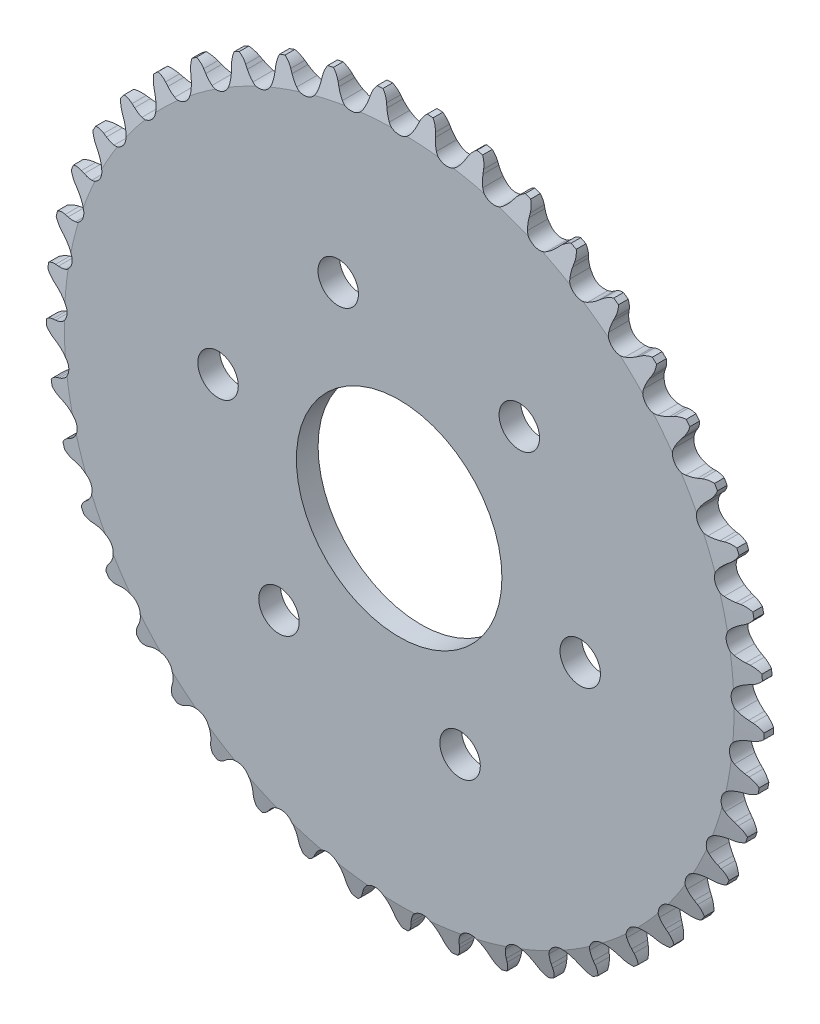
from build123d import *

# Parameters (mm, degrees)
CUT_EXTRUDE1_DEPTH      = 101.381797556
CIRPATTERN1_COUNT       = 45
CUT_EXTRUDE2_DEPTH      = 101.363786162
CUT_EXTRUDE2_DEPTH_BACK = 101.363786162
SKETCH3_R               = 6.35
SKETCH5_R               = 4
CUT_EXTRUDE3_DEPTH      = 101.43261116
CIRPATTERN2_COUNT       = 6
SKETCH6_R               = 20.32
CUT_EXTRUDE4_DEPTH      = 4.2926


with BuildPart() as part:
    # Sketch1 → Revolve1 (revolve)
    with BuildSketch(Plane(origin=(0, 0, 0), x_dir=(0, 0, -1), z_dir=(1, 0, 0)), mode=Mode.PRIVATE) as revolve1_sk:
        Polygon((2.1463, 0), (-2.1463, 0), (-2.1463, 66.201923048), (-0.955675, 70.964423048), (0.955675, 70.964423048), (2.1463, 66.201923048), align=None)
    revolve(revolve1_sk.sketch.rotate(Axis((0, 0, -2.1463), (0, 0, 1)), 90), axis=Axis((0, 0, -2.1463), (0, 0, 1)))

    # Sketch0 → Cut-Extrude1 (cut, symmetric)
    with BuildSketch(Plane.XY):
        with BuildLine():
            Line((8.059102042, -68.752061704), (7.763789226, -68.075402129))
            ThreePointArc((7.763789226, -68.075402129), (7.310869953, -67.215151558), (6.73744589, -66.430070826))
            ThreePointArc((6.73744589, -66.430070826), (4.581774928, -65.522434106), (2.573401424, -66.72124918))
            ThreePointArc((2.573401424, -66.72124918), (2.114820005, -67.578494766), (1.78603225, -68.493407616))
            Line((1.78603225, -68.493407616), (1.587766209, -69.204581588))
            ThreePointArc((1.587766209, -69.204581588), (0.065884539, -71.404321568), (-2.49042048, -72.191902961))
            ThreePointArc((-2.49042048, -72.191902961), (5.038848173, -72.058886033), (12.513354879, -71.142736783))
            ThreePointArc((12.513354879, -71.142736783), (9.8723175, -70.718588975), (8.059102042, -68.752061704))
        make_face()
    cut_extrude1 = extrude(amount=CUT_EXTRUDE1_DEPTH, both=True, mode=Mode.SUBTRACT)

    # CirPattern1: Cut-Extrude1 ×45 about axis
    cirpattern1_axis = Axis((0, 0, 0), (0, 0, 1))
    for i in range(1, CIRPATTERN1_COUNT):
        add(cut_extrude1.rotate(cirpattern1_axis, i * 360 / CIRPATTERN1_COUNT), mode=Mode.SUBTRACT)

    # Sketch3 → Cut-Extrude2 (cut, two sides: drawn at the far end of the back side and taken through both)
    with BuildSketch(Plane.XY.offset(-CUT_EXTRUDE2_DEPTH_BACK)):
        Circle(SKETCH3_R)
    extrude(amount=CUT_EXTRUDE2_DEPTH + CUT_EXTRUDE2_DEPTH_BACK, mode=Mode.SUBTRACT)

    # Sketch5 → Cut-Extrude3 (cut, through all)
    with BuildSketch(Plane.XY.offset(2.1463)):
        with Locations((23.757043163, 27.624896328)):
            Circle(SKETCH5_R)
    cut_extrude3 = extrude(amount=-CUT_EXTRUDE3_DEPTH, mode=Mode.SUBTRACT)

    # CirPattern2: Cut-Extrude3 ×6 about axis
    cirpattern2_axis = Axis((0, 0, 0), (0, 0, 1))
    for i in range(1, CIRPATTERN2_COUNT):
        add(cut_extrude3.rotate(cirpattern2_axis, i * 360 / CIRPATTERN2_COUNT), mode=Mode.SUBTRACT)

    # Sketch6 → Cut-Extrude4 (cut)
    with BuildSketch(Plane.XY.offset(2.1463)):
        Circle(SKETCH6_R)
    extrude(amount=-CUT_EXTRUDE4_DEPTH, mode=Mode.SUBTRACT)


solid = part.part
